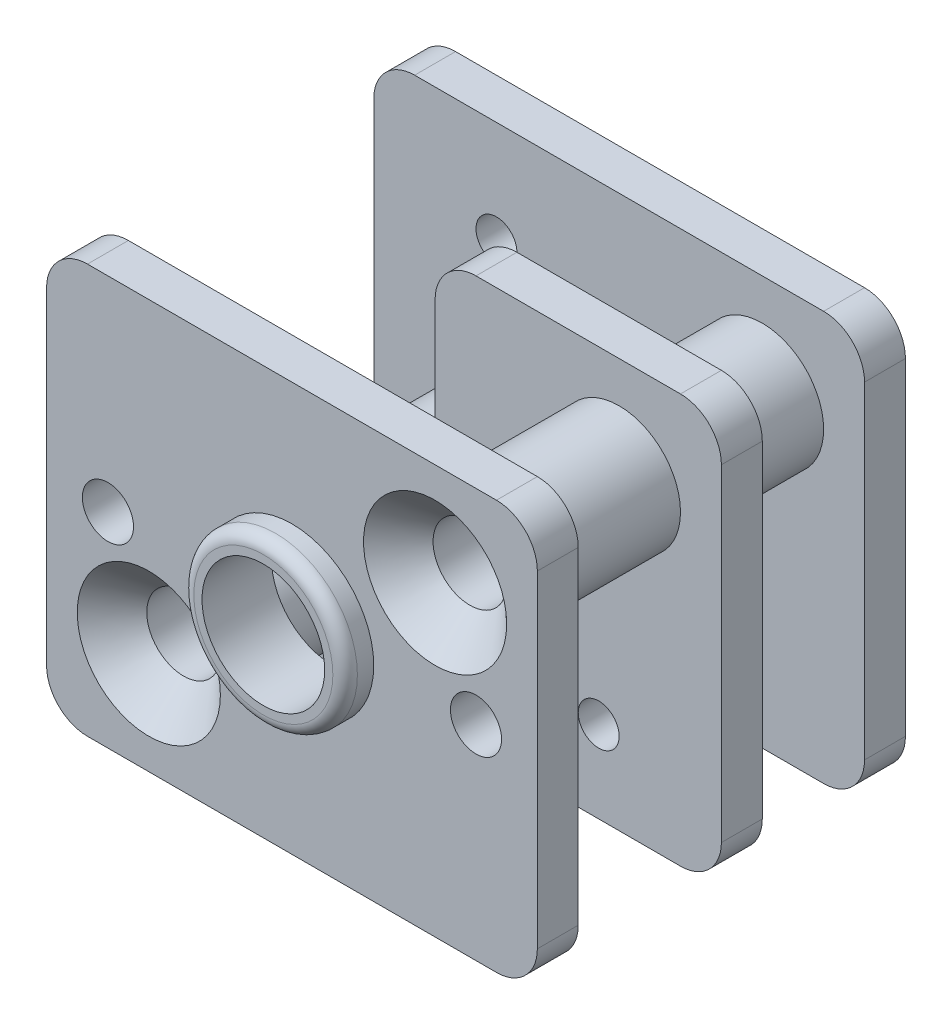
from build123d import *

# Parameters (mm, degrees)
SKETCH_1_W               = 12
SKETCH_1_H               = 10
SKETCH_1_R               = 1.5
EXTRUDE_1_DEPTH          = 1
SKETCH_4_R               = 1.5
SKETCH_4_R_2             = 0.9
EXTRUDE_2_DEPTH          = 3.5
SKETCH_5_R               = 0.5
EXTRUDE_3_DEPTH          = 1
SKETCH_6_R               = 1.5
SKETCH_6_R_2             = 0.9
EXTRUDE_4_DEPTH          = 2.5
SKETCH_7_W               = 12
SKETCH_7_H               = 10
SKETCH_7_R               = 0.532937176
SKETCH_7_R_2             = 0.5
EXTRUDE_5_DEPTH          = 1
FILLET_1_R               = 1
HOLE_WIZARD_1_AT_2_COUNT = 2
HOLE_WIZARD_1_AT_2_PITCH = 8.602325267
HOLE_WIZARD_M1_6_1_D     = 1.25
HOLE_WIZARD_M1_6_1_DEPTH = 1
SKETCH_12_R              = 2
SKETCH_12_R_2            = 1.5
EXTRUDE_6_DEPTH          = 0.7
FILLET_2_R               = 0.3


with BuildPart() as part:
    # Sketch 1 → Extrude 1 (new body)
    with BuildSketch(Plane.XY):
        Rectangle(SKETCH_1_W, SKETCH_1_H)
        Circle(SKETCH_1_R, mode=Mode.SUBTRACT)
    extrude(amount=EXTRUDE_1_DEPTH)

    # Sketch 4 → Extrude 2 (add)
    # profile 1 of 2: a face of its own
    with BuildSketch(Plane(origin=(0, 0, 0), x_dir=(-1, 0, 0), z_dir=(0, 0, -1))):
        with Locations(Location((-3.5, 2.5, 0), (0, 0, 180))):
            Circle(SKETCH_4_R)
        with Locations((-3.5, 2.5)):
            Circle(SKETCH_4_R_2, mode=Mode.SUBTRACT)
    # profile 2 of 2: a face of its own
    with BuildSketch(Plane(origin=(0, 0, 0), x_dir=(-1, 0, 0), z_dir=(0, 0, -1))):
        with Locations(Location((3.5, -2.5, 0), (0, 0, 180))):
            Circle(SKETCH_4_R)
        with Locations((3.5, -2.5)):
            Circle(SKETCH_4_R_2, mode=Mode.SUBTRACT)
    extrude(amount=EXTRUDE_2_DEPTH)

    # Sketch 5 → Extrude 3 (add)
    with BuildSketch(Plane(origin=(0, 0, -3.5), x_dir=(-1, 0, 0), z_dir=(0, 0, -1))):
        Polygon((-6, -5), (-6, 5), (1, 5), (1, 0), (6, 0), (6, -5), align=None)
        with Locations((-3, -3)):
            Circle(SKETCH_5_R, mode=Mode.SUBTRACT)
        Circle(SKETCH_5_R, mode=Mode.SUBTRACT)
    extrude(amount=EXTRUDE_3_DEPTH)

    # Sketch 6 → Extrude 4 (add)
    # profile 1 of 2: a face of its own
    with BuildSketch(Plane(origin=(0, 0, -4.5), x_dir=(-1, 0, 0), z_dir=(0, 0, -1))):
        with Locations(Location((3.5, -2.5, 0), (0, 0, 180))):
            Circle(SKETCH_6_R)
        with Locations((3.5, -2.5)):
            Circle(SKETCH_6_R_2, mode=Mode.SUBTRACT)
    # profile 2 of 2: a face of its own
    with BuildSketch(Plane(origin=(0, 0, -4.5), x_dir=(-1, 0, 0), z_dir=(0, 0, -1))):
        with Locations(Location((-3.5, 2.5, 0), (0, 0, 180))):
            Circle(SKETCH_6_R)
        with Locations((-3.5, 2.5)):
            Circle(SKETCH_6_R_2, mode=Mode.SUBTRACT)
    extrude(amount=EXTRUDE_4_DEPTH)

    # Sketch 7 → Extrude 5 (add)
    with BuildSketch(Plane(origin=(0, 0, -7), x_dir=(-1, 0, 0), z_dir=(0, 0, -1))):
        Rectangle(SKETCH_7_W, SKETCH_7_H)
        Circle(SKETCH_7_R, mode=Mode.SUBTRACT)
        with Locations((3, 2.5)):
            Circle(SKETCH_7_R_2, mode=Mode.SUBTRACT)
    extrude(amount=EXTRUDE_5_DEPTH)

    # Fillet 1
    fillet_1_edges = [part.edges().sort_by_distance(p)[0] for p in [
        (6, -5, -4),
        (-6, -5, -4),
        (-6, 0, -4),
        (-1, 0, -4),
        (-1, 5, -4),
        (6, 5, -4),
        (-6, 5, -7.5),
        (6, 5, -7.5),
        (6, -5, -7.5),
        (-6, -5, -7.5),
        (6, -5, 0.5),
        (-6, -5, 0.5),
        (-6, 5, 0.5),
        (6, 5, 0.5),
    ]]
    fillet(fillet_1_edges, radius=FILLET_1_R)

    # Sketch 8 → Hole Wizard 1 (revolve, cut)
    with BuildSketch(Plane(origin=(3.5, 2.5, 1), x_dir=(0, -1, 0), z_dir=(1, 0, 0))):
        Polygon((0, 0), (0, 1), (0.9, 1), (0.9, 0.85), (1.75, 0), align=None)
    hole_wizard_1 = revolve(axis=Axis((3.5, 2.5, 7.35), (0, 0, -1)), mode=Mode.SUBTRACT)

    # Hole Wizard 1 at 2: Hole Wizard 1 ×2
    with Locations(*[Vector(-0.813733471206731, -0.5812381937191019, 0) * (i * HOLE_WIZARD_1_AT_2_PITCH) for i in range(1, HOLE_WIZARD_1_AT_2_COUNT)]):
        add(hole_wizard_1, mode=Mode.SUBTRACT)

    # Hole Wizard M1.6 _1
    with Locations(Plane.XY.offset(1)):
        with Locations((4.5, 0), (-4.5, 0)):
            Hole(HOLE_WIZARD_M1_6_1_D / 2, depth=HOLE_WIZARD_M1_6_1_DEPTH)

    # Sketch 12 → Extrude 6 (add)
    with BuildSketch(Plane.XY.offset(1)):
        Circle(SKETCH_12_R)
        Circle(SKETCH_12_R_2, mode=Mode.SUBTRACT)
    extrude(amount=EXTRUDE_6_DEPTH)

    # Fillet 2
    fillet_2_edges = [part.edges().sort_by_distance(p)[0] for p in [
        (-2, 0, 1.7),
    ]]
    fillet(fillet_2_edges, radius=FILLET_2_R)


solid = part.part
